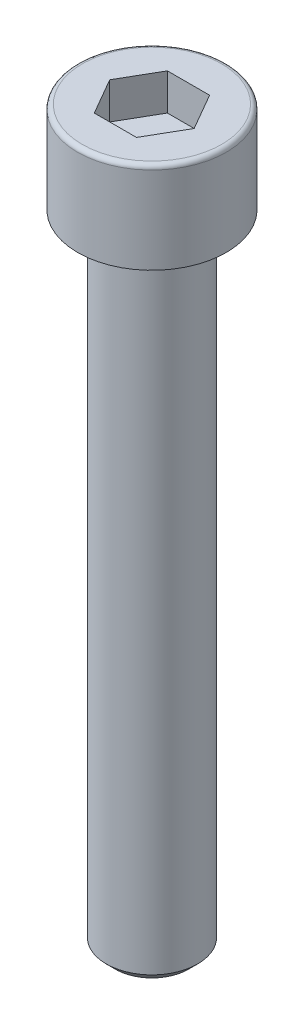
from build123d import *

# Parameters (mm, degrees)
CHANFREIN1_SIZE         = 1
ENL_V_MAT_EXTRU_3_DEPTH = 4


with BuildPart() as part:
    # Esquisse1 → Base-R_volution (revolve)
    with BuildSketch(Plane.XY, mode=Mode.PRIVATE) as base_r_volution_sk:
        with BuildLine():
            Line((0, 80), (-7.635, 80))
            ThreePointArc((-7.635, 80), (-7.988553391, 79.853553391), (-8.135, 79.5))
            Line((-8.135, 79.5), (-8.135, 70))
            Line((-8.135, 70), (-5, 70))
            Line((-5, 70), (-5, 0))
            Line((-5, 0), (0, 0))
            Line((0, 0), (0, 80))
        make_face()
    revolve(base_r_volution_sk.sketch.rotate(Axis((0, 54.802767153, 0), (0, -1, 0)), 270), axis=Axis((0, 54.802767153, 0), (0, -1, 0)))

    # Chanfrein1
    chanfrein1_edges = [part.edges().sort_by_distance(p)[0] for p in [
        (0, 0, -5),
    ]]
    chamfer(chanfrein1_edges, length=CHANFREIN1_SIZE)

    # Esquisse4 → Enl_v. mat.-Extru.3 (cut)
    with BuildSketch(Plane(origin=(0, 80, 0), x_dir=(-1, 0, 0), z_dir=(0, 1, 0))):
        Polygon((2.309401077, 4), (-2.309401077, 4), (-4.618802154, 0), (-2.309401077, -4), (2.309401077, -4), (4.618802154, 0), align=None)
    extrude(amount=-ENL_V_MAT_EXTRU_3_DEPTH, mode=Mode.SUBTRACT)


solid = part.part
